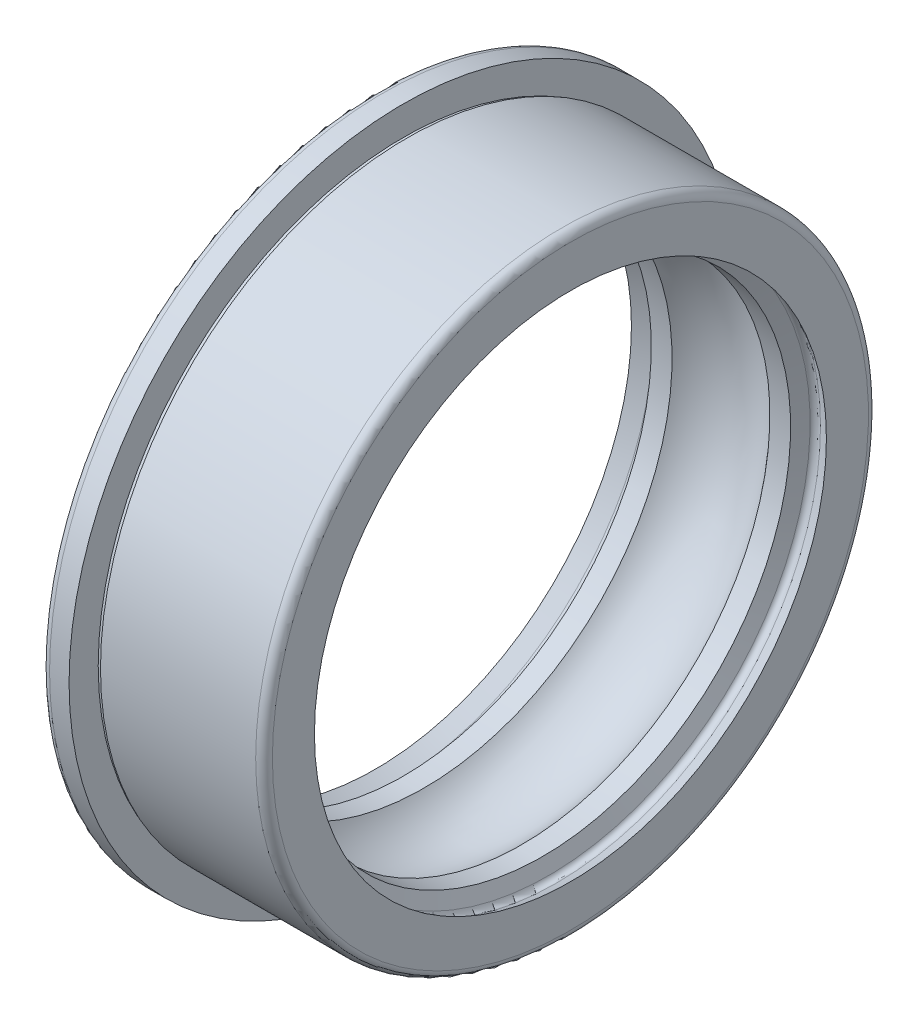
from build123d import *


with BuildPart() as part:
    # Esquisse1 → Base-R_volution (revolve)
    with BuildSketch(Plane.XY, mode=Mode.PRIVATE) as base_r_volution_sk:
        with BuildLine():
            Line((0, 9.190779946), (0, 11.7))
            ThreePointArc((0, 11.7), (0.087867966, 11.912132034), (0.3, 12))
            Line((0.3, 12), (1, 12))
            Line((1, 12), (1, 10.952794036))
            Line((1, 10.952794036), (1.127864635, 10.952794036))
            Line((1.127864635, 10.952794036), (1.127864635, 11))
            Line((1.127864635, 11), (6.7, 11))
            ThreePointArc((6.7, 11), (6.912132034, 10.912132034), (7, 10.7))
            Line((7, 10.7), (7, 9.190779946))
            Line((7, 9.190779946), (6.5, 9.479455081))
            ThreePointArc((6.5, 9.479455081), (6.338686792, 9.496619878), (6.217712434, 9.388537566))
            Line((6.217712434, 9.388537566), (6, 8.90625))
            Line((6, 8.90625), (5.256405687, 8.90625))
            ThreePointArc((5.256405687, 8.90625), (3.5, 9.75), (1.743594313, 8.90625))
            Line((1.743594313, 8.90625), (1, 8.90625))
            Line((1, 8.90625), (0.782287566, 9.388537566))
            ThreePointArc((0.782287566, 9.388537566), (0.661313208, 9.496619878), (0.5, 9.479455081))
            Line((0.5, 9.479455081), (0, 9.190779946))
        make_face()
    revolve(base_r_volution_sk.sketch.rotate(Axis((-13, 0, 0), (1, 0, 0)), 90), axis=Axis((-13, 0, 0), (1, 0, 0)))


solid = part.part
